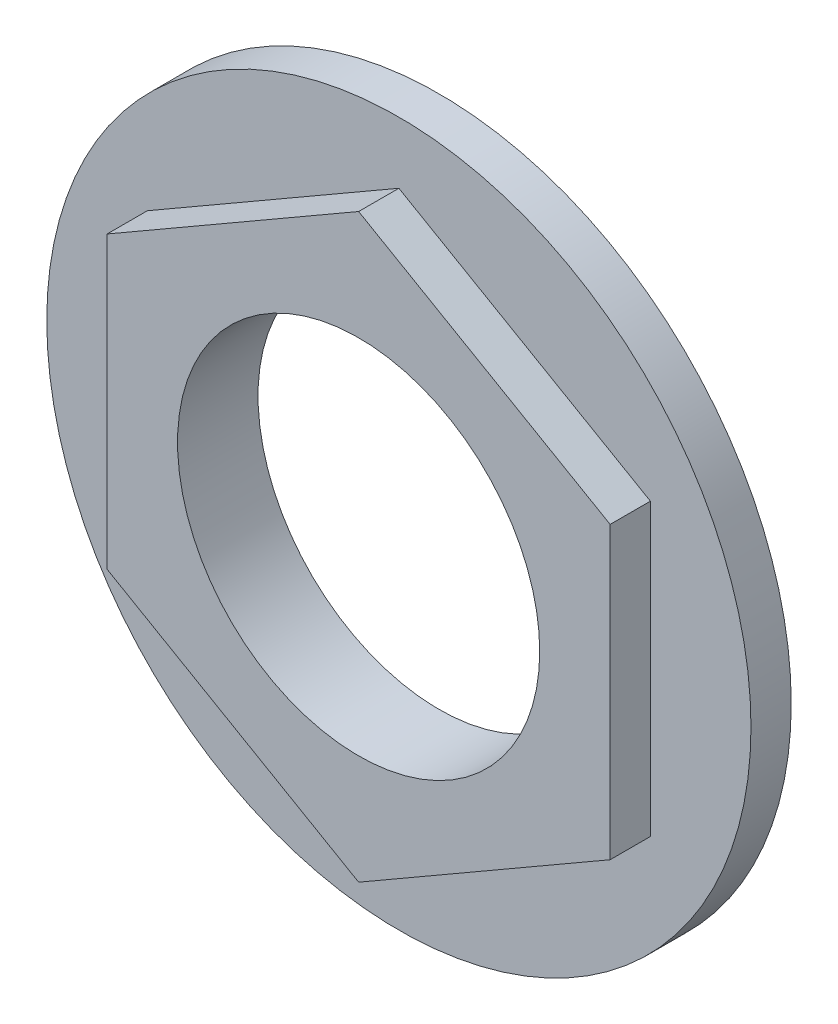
ISO-10303-21;
HEADER;
FILE_DESCRIPTION(('STEP AP214'),'2;1');
FILE_NAME('part.step','',(''),(''),'','','');
FILE_SCHEMA(('AUTOMOTIVE_DESIGN { 1 0 10303 214 1 1 1 1 }'));
ENDSEC;
DATA;
#1=APPLICATION_CONTEXT('core data for automotive mechanical design processes');
#2=APPLICATION_PROTOCOL_DEFINITION('international standard','automotive_design',2000,#1);
#3=PRODUCT_CONTEXT('',#1,'mechanical');
#4=PRODUCT('Part','Part','',(#3));
#5=PRODUCT_RELATED_PRODUCT_CATEGORY('part','',(#4));
#6=PRODUCT_DEFINITION_FORMATION('','',#4);
#7=PRODUCT_DEFINITION_CONTEXT('part definition',#1,'design');
#8=PRODUCT_DEFINITION('design','',#6,#7);
#9=PRODUCT_DEFINITION_SHAPE('','',#8);
#10=(LENGTH_UNIT() NAMED_UNIT(*) SI_UNIT(.MILLI.,.METRE.));
#11=(NAMED_UNIT(*) PLANE_ANGLE_UNIT() SI_UNIT($,.RADIAN.));
#12=(NAMED_UNIT(*) SI_UNIT($,.STERADIAN.) SOLID_ANGLE_UNIT());
#13=UNCERTAINTY_MEASURE_WITH_UNIT(LENGTH_MEASURE(1.E-05),#10,'distance_accuracy_value','');
#14=(GEOMETRIC_REPRESENTATION_CONTEXT(3) GLOBAL_UNCERTAINTY_ASSIGNED_CONTEXT((#13)) GLOBAL_UNIT_ASSIGNED_CONTEXT((#10,
#11,#12)) REPRESENTATION_CONTEXT('',''));
#15=CARTESIAN_POINT('',(0.,0.,0.));
#16=DIRECTION('',(0.,0.,1.));
#17=DIRECTION('',(1.,0.,0.));
#18=AXIS2_PLACEMENT_3D('',#15,#16,#17);
#19=CARTESIAN_POINT('',(0.,0.,1.));
#20=DIRECTION('',(0.,0.,1.));
#21=DIRECTION('',(1.,0.,0.));
#22=AXIS2_PLACEMENT_3D('',#19,#20,#21);
#23=PLANE('',#22);
#24=CARTESIAN_POINT('',(0.,0.,1.));
#25=DIRECTION('',(0.,0.,1.));
#26=DIRECTION('',(1.,0.,0.));
#27=AXIS2_PLACEMENT_3D('',#24,#25,#26);
#28=CIRCLE('',#27,8.75);
#29=CARTESIAN_POINT('',(8.75,0.,1.));
#30=VERTEX_POINT('',#29);
#31=EDGE_CURVE('E11',#30,#30,#28,.T.);
#32=ORIENTED_EDGE('',*,*,#31,.T.);
#33=EDGE_LOOP('',(#32));
#34=FACE_BOUND('',#33,.T.);
#35=DIRECTION('',(-0.866025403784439,-0.5,0.));
#36=VECTOR('',#35,1.);
#37=CARTESIAN_POINT('',(0.,7.21687836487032,1.));
#38=LINE('',#37,#36);
#39=CARTESIAN_POINT('',(0.,7.21687836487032,1.));
#40=VERTEX_POINT('',#39);
#41=CARTESIAN_POINT('',(-6.25,3.60843918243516,1.));
#42=VERTEX_POINT('',#41);
#43=EDGE_CURVE('E120',#40,#42,#38,.T.);
#44=ORIENTED_EDGE('',*,*,#43,.F.);
#45=DIRECTION('',(-0.866025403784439,0.5,0.));
#46=VECTOR('',#45,1.);
#47=CARTESIAN_POINT('',(6.25,3.60843918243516,1.));
#48=LINE('',#47,#46);
#49=CARTESIAN_POINT('',(6.25,3.60843918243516,1.));
#50=VERTEX_POINT('',#49);
#51=EDGE_CURVE('E117',#50,#40,#48,.T.);
#52=ORIENTED_EDGE('',*,*,#51,.F.);
#53=DIRECTION('',(0.,1.,0.));
#54=VECTOR('',#53,1.);
#55=CARTESIAN_POINT('',(6.25,-3.60843918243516,1.));
#56=LINE('',#55,#54);
#57=CARTESIAN_POINT('',(6.25,-3.60843918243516,1.));
#58=VERTEX_POINT('',#57);
#59=EDGE_CURVE('E76',#58,#50,#56,.T.);
#60=ORIENTED_EDGE('',*,*,#59,.F.);
#61=DIRECTION('',(0.866025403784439,0.5,0.));
#62=VECTOR('',#61,1.);
#63=CARTESIAN_POINT('',(0.,-7.21687836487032,1.));
#64=LINE('',#63,#62);
#65=CARTESIAN_POINT('',(0.,-7.21687836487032,1.));
#66=VERTEX_POINT('',#65);
#67=EDGE_CURVE('E126',#66,#58,#64,.T.);
#68=ORIENTED_EDGE('',*,*,#67,.F.);
#69=DIRECTION('',(0.866025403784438,-0.5,0.));
#70=VECTOR('',#69,1.);
#71=CARTESIAN_POINT('',(-6.25,-3.60843918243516,1.));
#72=LINE('',#71,#70);
#73=CARTESIAN_POINT('',(-6.25,-3.60843918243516,1.));
#74=VERTEX_POINT('',#73);
#75=EDGE_CURVE('E106',#74,#66,#72,.T.);
#76=ORIENTED_EDGE('',*,*,#75,.F.);
#77=DIRECTION('',(0.,-1.,0.));
#78=VECTOR('',#77,1.);
#79=CARTESIAN_POINT('',(-6.25,3.60843918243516,1.));
#80=LINE('',#79,#78);
#81=EDGE_CURVE('E123',#42,#74,#80,.T.);
#82=ORIENTED_EDGE('',*,*,#81,.F.);
#83=EDGE_LOOP('',(#44,#52,#60,#68,#76,#82));
#84=FACE_BOUND('',#83,.T.);
#85=ADVANCED_FACE('F33',(#34,#84),#23,.T.);
#86=CARTESIAN_POINT('',(0.,0.,1.));
#87=DIRECTION('',(0.,0.,-1.));
#88=DIRECTION('',(-1.,0.,0.));
#89=AXIS2_PLACEMENT_3D('',#86,#87,#88);
#90=CYLINDRICAL_SURFACE('',#89,8.75);
#91=ORIENTED_EDGE('',*,*,#31,.F.);
#92=EDGE_LOOP('',(#91));
#93=FACE_BOUND('',#92,.T.);
#94=CARTESIAN_POINT('',(0.,0.,0.));
#95=DIRECTION('',(0.,0.,1.));
#96=DIRECTION('',(1.,0.,0.));
#97=AXIS2_PLACEMENT_3D('',#94,#95,#96);
#98=CIRCLE('',#97,8.75);
#99=CARTESIAN_POINT('',(8.75,0.,0.));
#100=VERTEX_POINT('',#99);
#101=EDGE_CURVE('E37',#100,#100,#98,.T.);
#102=ORIENTED_EDGE('',*,*,#101,.T.);
#103=EDGE_LOOP('',(#102));
#104=FACE_BOUND('',#103,.T.);
#105=ADVANCED_FACE('F35',(#93,#104),#90,.T.);
#106=CARTESIAN_POINT('',(0.,0.,0.));
#107=DIRECTION('',(0.,0.,1.));
#108=DIRECTION('',(1.,0.,0.));
#109=AXIS2_PLACEMENT_3D('',#106,#107,#108);
#110=PLANE('',#109);
#111=CARTESIAN_POINT('',(0.,0.,0.));
#112=DIRECTION('',(0.,0.,1.));
#113=DIRECTION('',(1.,0.,0.));
#114=AXIS2_PLACEMENT_3D('',#111,#112,#113);
#115=CIRCLE('',#114,4.5);
#116=CARTESIAN_POINT('',(4.5,0.,0.));
#117=VERTEX_POINT('',#116);
#118=EDGE_CURVE('E121',#117,#117,#115,.F.);
#119=ORIENTED_EDGE('',*,*,#118,.F.);
#120=EDGE_LOOP('',(#119));
#121=FACE_BOUND('',#120,.T.);
#122=ORIENTED_EDGE('',*,*,#101,.F.);
#123=EDGE_LOOP('',(#122));
#124=FACE_BOUND('',#123,.T.);
#125=ADVANCED_FACE('F142',(#121,#124),#110,.F.);
#126=CARTESIAN_POINT('',(6.25,3.60843918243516,2.));
#127=DIRECTION('',(-0.5,-0.866025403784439,0.));
#128=DIRECTION('',(0.866025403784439,-0.5,0.));
#129=AXIS2_PLACEMENT_3D('',#126,#127,#128);
#130=PLANE('',#129);
#131=ORIENTED_EDGE('',*,*,#51,.T.);
#132=DIRECTION('',(0.,0.,-1.));
#133=VECTOR('',#132,1.);
#134=CARTESIAN_POINT('',(0.,7.21687836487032,2.));
#135=LINE('',#134,#133);
#136=CARTESIAN_POINT('',(0.,7.21687836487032,2.));
#137=VERTEX_POINT('',#136);
#138=EDGE_CURVE('E136',#137,#40,#135,.T.);
#139=ORIENTED_EDGE('',*,*,#138,.F.);
#140=DIRECTION('',(-0.866025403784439,0.5,0.));
#141=VECTOR('',#140,1.);
#142=CARTESIAN_POINT('',(6.25,3.60843918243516,2.));
#143=LINE('',#142,#141);
#144=CARTESIAN_POINT('',(6.25,3.60843918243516,2.));
#145=VERTEX_POINT('',#144);
#146=EDGE_CURVE('E129',#145,#137,#143,.T.);
#147=ORIENTED_EDGE('',*,*,#146,.F.);
#148=DIRECTION('',(0.,0.,-1.));
#149=VECTOR('',#148,1.);
#150=CARTESIAN_POINT('',(6.25,3.60843918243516,2.));
#151=LINE('',#150,#149);
#152=EDGE_CURVE('E113',#145,#50,#151,.T.);
#153=ORIENTED_EDGE('',*,*,#152,.T.);
#154=EDGE_LOOP('',(#131,#139,#147,#153));
#155=FACE_BOUND('',#154,.T.);
#156=ADVANCED_FACE('F144',(#155),#130,.F.);
#157=CARTESIAN_POINT('',(0.,7.21687836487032,2.));
#158=DIRECTION('',(0.5,-0.866025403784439,0.));
#159=DIRECTION('',(0.866025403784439,0.5,0.));
#160=AXIS2_PLACEMENT_3D('',#157,#158,#159);
#161=PLANE('',#160);
#162=ORIENTED_EDGE('',*,*,#43,.T.);
#163=DIRECTION('',(0.,0.,-1.));
#164=VECTOR('',#163,1.);
#165=CARTESIAN_POINT('',(-6.25,3.60843918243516,2.));
#166=LINE('',#165,#164);
#167=CARTESIAN_POINT('',(-6.25,3.60843918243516,2.));
#168=VERTEX_POINT('',#167);
#169=EDGE_CURVE('E133',#168,#42,#166,.T.);
#170=ORIENTED_EDGE('',*,*,#169,.F.);
#171=DIRECTION('',(-0.866025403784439,-0.5,0.));
#172=VECTOR('',#171,1.);
#173=CARTESIAN_POINT('',(0.,7.21687836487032,2.));
#174=LINE('',#173,#172);
#175=EDGE_CURVE('E84',#137,#168,#174,.T.);
#176=ORIENTED_EDGE('',*,*,#175,.F.);
#177=ORIENTED_EDGE('',*,*,#138,.T.);
#178=EDGE_LOOP('',(#162,#170,#176,#177));
#179=FACE_BOUND('',#178,.T.);
#180=ADVANCED_FACE('F150',(#179),#161,.F.);
#181=CARTESIAN_POINT('',(-6.25,3.60843918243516,2.));
#182=DIRECTION('',(1.,0.,0.));
#183=DIRECTION('',(0.,0.,-1.));
#184=AXIS2_PLACEMENT_3D('',#181,#182,#183);
#185=PLANE('',#184);
#186=ORIENTED_EDGE('',*,*,#81,.T.);
#187=DIRECTION('',(0.,0.,-1.));
#188=VECTOR('',#187,1.);
#189=CARTESIAN_POINT('',(-6.25,-3.60843918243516,2.));
#190=LINE('',#189,#188);
#191=CARTESIAN_POINT('',(-6.25,-3.60843918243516,2.));
#192=VERTEX_POINT('',#191);
#193=EDGE_CURVE('E109',#192,#74,#190,.T.);
#194=ORIENTED_EDGE('',*,*,#193,.F.);
#195=DIRECTION('',(0.,-1.,0.));
#196=VECTOR('',#195,1.);
#197=CARTESIAN_POINT('',(-6.25,3.60843918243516,2.));
#198=LINE('',#197,#196);
#199=EDGE_CURVE('E97',#168,#192,#198,.T.);
#200=ORIENTED_EDGE('',*,*,#199,.F.);
#201=ORIENTED_EDGE('',*,*,#169,.T.);
#202=EDGE_LOOP('',(#186,#194,#200,#201));
#203=FACE_BOUND('',#202,.T.);
#204=ADVANCED_FACE('F164',(#203),#185,.F.);
#205=CARTESIAN_POINT('',(-6.25,-3.60843918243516,2.));
#206=DIRECTION('',(0.5,0.866025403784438,0.));
#207=DIRECTION('',(-0.866025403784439,0.5,0.));
#208=AXIS2_PLACEMENT_3D('',#205,#206,#207);
#209=PLANE('',#208);
#210=ORIENTED_EDGE('',*,*,#75,.T.);
#211=DIRECTION('',(0.,0.,-1.));
#212=VECTOR('',#211,1.);
#213=CARTESIAN_POINT('',(0.,-7.21687836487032,2.));
#214=LINE('',#213,#212);
#215=CARTESIAN_POINT('',(0.,-7.21687836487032,2.));
#216=VERTEX_POINT('',#215);
#217=EDGE_CURVE('E103',#216,#66,#214,.T.);
#218=ORIENTED_EDGE('',*,*,#217,.F.);
#219=DIRECTION('',(0.866025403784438,-0.5,0.));
#220=VECTOR('',#219,1.);
#221=CARTESIAN_POINT('',(-6.25,-3.60843918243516,2.));
#222=LINE('',#221,#220);
#223=EDGE_CURVE('E91',#192,#216,#222,.T.);
#224=ORIENTED_EDGE('',*,*,#223,.F.);
#225=ORIENTED_EDGE('',*,*,#193,.T.);
#226=EDGE_LOOP('',(#210,#218,#224,#225));
#227=FACE_BOUND('',#226,.T.);
#228=ADVANCED_FACE('F104',(#227),#209,.F.);
#229=CARTESIAN_POINT('',(0.,-7.21687836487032,2.));
#230=DIRECTION('',(-0.5,0.866025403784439,0.));
#231=DIRECTION('',(-0.866025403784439,-0.5,0.));
#232=AXIS2_PLACEMENT_3D('',#229,#230,#231);
#233=PLANE('',#232);
#234=ORIENTED_EDGE('',*,*,#67,.T.);
#235=DIRECTION('',(0.,0.,-1.));
#236=VECTOR('',#235,1.);
#237=CARTESIAN_POINT('',(6.25,-3.60843918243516,2.));
#238=LINE('',#237,#236);
#239=CARTESIAN_POINT('',(6.25,-3.60843918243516,2.));
#240=VERTEX_POINT('',#239);
#241=EDGE_CURVE('E48',#240,#58,#238,.T.);
#242=ORIENTED_EDGE('',*,*,#241,.F.);
#243=DIRECTION('',(0.866025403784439,0.5,0.));
#244=VECTOR('',#243,1.);
#245=CARTESIAN_POINT('',(0.,-7.21687836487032,2.));
#246=LINE('',#245,#244);
#247=EDGE_CURVE('E95',#216,#240,#246,.T.);
#248=ORIENTED_EDGE('',*,*,#247,.F.);
#249=ORIENTED_EDGE('',*,*,#217,.T.);
#250=EDGE_LOOP('',(#234,#242,#248,#249));
#251=FACE_BOUND('',#250,.T.);
#252=ADVANCED_FACE('F111',(#251),#233,.F.);
#253=CARTESIAN_POINT('',(6.25,-3.60843918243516,2.));
#254=DIRECTION('',(-1.,0.,0.));
#255=DIRECTION('',(0.,-1.,0.));
#256=AXIS2_PLACEMENT_3D('',#253,#254,#255);
#257=PLANE('',#256);
#258=ORIENTED_EDGE('',*,*,#59,.T.);
#259=ORIENTED_EDGE('',*,*,#152,.F.);
#260=DIRECTION('',(0.,1.,0.));
#261=VECTOR('',#260,1.);
#262=CARTESIAN_POINT('',(6.25,-3.60843918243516,2.));
#263=LINE('',#262,#261);
#264=EDGE_CURVE('E56',#240,#145,#263,.T.);
#265=ORIENTED_EDGE('',*,*,#264,.F.);
#266=ORIENTED_EDGE('',*,*,#241,.T.);
#267=EDGE_LOOP('',(#258,#259,#265,#266));
#268=FACE_BOUND('',#267,.T.);
#269=ADVANCED_FACE('F172',(#268),#257,.F.);
#270=CARTESIAN_POINT('',(0.,0.,2.));
#271=DIRECTION('',(0.,0.,1.));
#272=DIRECTION('',(1.,0.,0.));
#273=AXIS2_PLACEMENT_3D('',#270,#271,#272);
#274=PLANE('',#273);
#275=CARTESIAN_POINT('',(0.,0.,2.));
#276=DIRECTION('',(0.,0.,1.));
#277=DIRECTION('',(1.,0.,0.));
#278=AXIS2_PLACEMENT_3D('',#275,#276,#277);
#279=CIRCLE('',#278,4.5);
#280=CARTESIAN_POINT('',(4.5,0.,2.));
#281=VERTEX_POINT('',#280);
#282=EDGE_CURVE('E186',#281,#281,#279,.T.);
#283=ORIENTED_EDGE('',*,*,#282,.F.);
#284=EDGE_LOOP('',(#283));
#285=FACE_BOUND('',#284,.T.);
#286=ORIENTED_EDGE('',*,*,#146,.T.);
#287=ORIENTED_EDGE('',*,*,#175,.T.);
#288=ORIENTED_EDGE('',*,*,#199,.T.);
#289=ORIENTED_EDGE('',*,*,#223,.T.);
#290=ORIENTED_EDGE('',*,*,#247,.T.);
#291=ORIENTED_EDGE('',*,*,#264,.T.);
#292=EDGE_LOOP('',(#286,#287,#288,#289,#290,#291));
#293=FACE_BOUND('',#292,.T.);
#294=ADVANCED_FACE('F93',(#285,#293),#274,.T.);
#295=CARTESIAN_POINT('',(0.,0.,-0.00100000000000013));
#296=DIRECTION('',(0.,0.,1.));
#297=DIRECTION('',(1.,0.,0.));
#298=AXIS2_PLACEMENT_3D('',#295,#296,#297);
#299=CYLINDRICAL_SURFACE('',#298,4.5);
#300=ORIENTED_EDGE('',*,*,#282,.T.);
#301=EDGE_LOOP('',(#300));
#302=FACE_BOUND('',#301,.T.);
#303=ORIENTED_EDGE('',*,*,#118,.T.);
#304=EDGE_LOOP('',(#303));
#305=FACE_BOUND('',#304,.T.);
#306=ADVANCED_FACE('F177',(#302,#305),#299,.F.);
#307=CLOSED_SHELL('',(#85,#105,#125,#156,#180,#204,#228,#252,#269,#294,#306));
#308=MANIFOLD_SOLID_BREP('B2',#307);
#309=ADVANCED_BREP_SHAPE_REPRESENTATION('',(#18,#308),#14);
#310=SHAPE_DEFINITION_REPRESENTATION(#9,#309);
ENDSEC;
END-ISO-10303-21;
